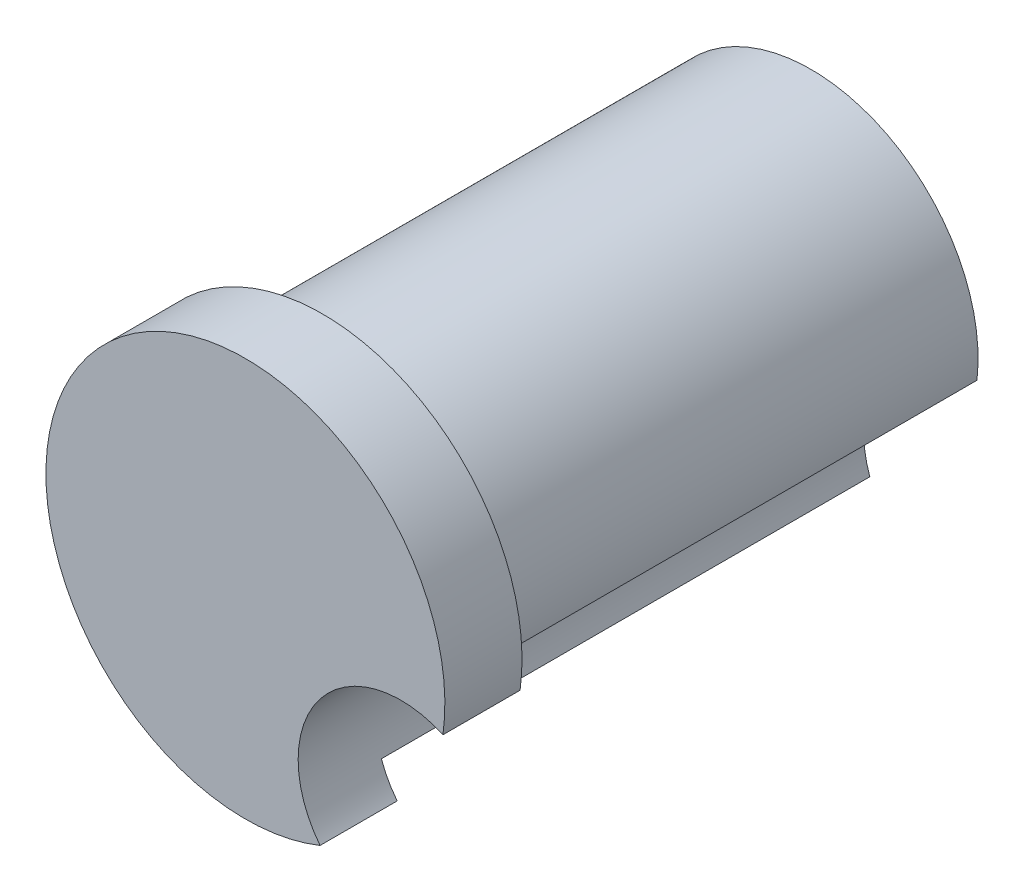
from build123d import *

# Parameters (mm, degrees)
SKETCH3_R          = 6.35
CUT_EXTRUDE1_DEPTH = 40.028948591


with BuildPart() as part:
    # Sketch2 → Revolve1 (revolve)
    with BuildSketch(Plane(origin=(0, 0, 0), x_dir=(1, 0, 0), z_dir=(0, 1, 0))):
        Polygon((0, 0), (0, -34.925), (12.31875, -34.925), (12.31875, -30.1625), (10.31875, -30.1625), (10.31875, 0), align=None)
    revolve(axis=Axis((0, 0, 34.925), (0, 0, -1)))

    # Sketch3 → Cut-Extrude1 (cut, through all)
    with BuildSketch(Plane(origin=(0, 0, 0), x_dir=(-1, 0, 0), z_dir=(0, 0, -1))):
        with Locations((-9.607427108, -7.506144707)):
            Circle(SKETCH3_R)
    extrude(amount=-CUT_EXTRUDE1_DEPTH, mode=Mode.SUBTRACT)


solid = part.part
